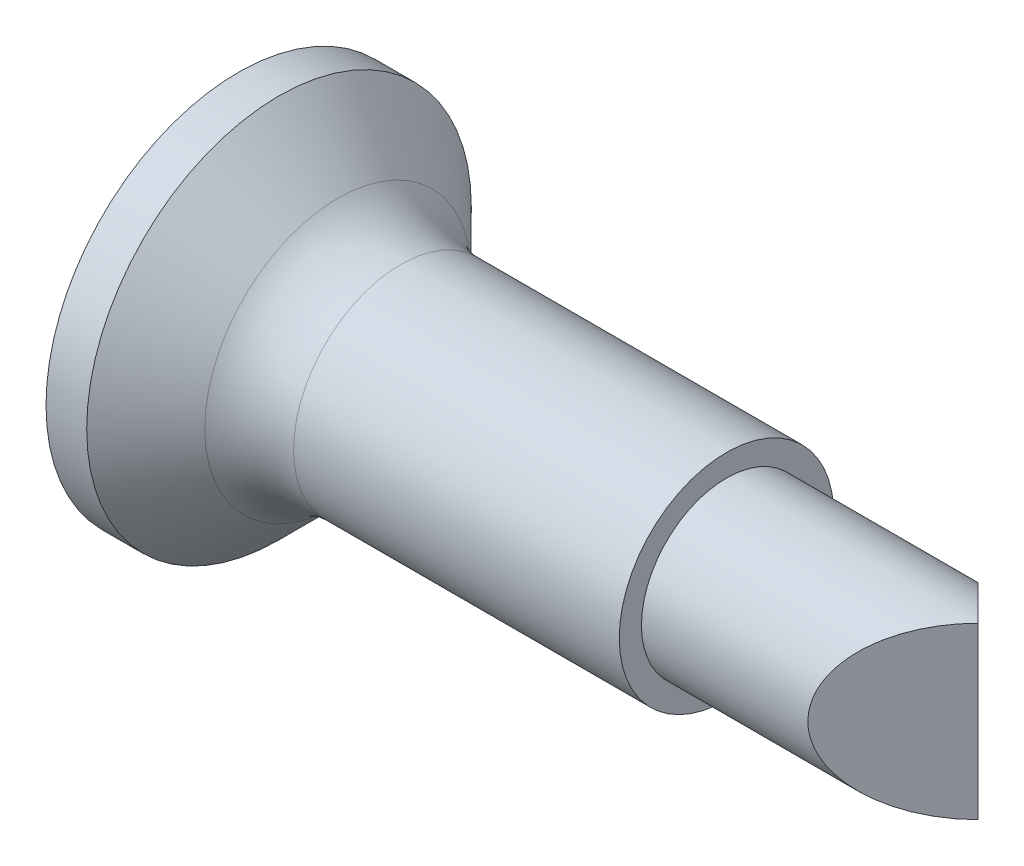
from build123d import *

# Parameters (mm, degrees)
CUT_EXTRUDE1_DEPTH      = 12.314150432
CUT_EXTRUDE1_DEPTH_BACK = 12.314150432
CROSSRECESS_DEPTH       = 0.85
FILLET1_R               = 1.2
FILLET2_R               = 0.34
DRAFT1_ANGLE            = -25


with BuildPart() as part:
    # Sketch1 → Base (revolve)
    with BuildSketch(Plane.XY, mode=Mode.PRIVATE) as base_sk:
        with BuildLine():
            Line((0.7, 2.6), (1.25, 2.6))
            Line((1.25, 2.6), (2.4, 1.45))
            Line((2.4, 1.45), (7.3, 1.45))
            Line((7.3, 1.45), (7.3, 1.15))
            Line((7.3, 1.15), (10.7, 1.15))
            Line((10.7, 1.15), (10.7, 0))
            Line((10.7, 0), (0, 0))
            ThreePointArc((0, 0), (0.178061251, 1.346291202), (0.7, 2.6))
        make_face()
    revolve(base_sk.sketch.rotate(Axis((-68.714227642, 0, 0), (1, 0, 0)), 90), axis=Axis((-68.714227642, 0, 0), (1, 0, 0)))

    # Sketch2 → Cut-Extrude1 (cut, two sides: drawn at the far end of the back side and taken through both)
    with BuildSketch(Plane(origin=(0, 0, 0), x_dir=(1, 0, 0), z_dir=(0, 1, 0)).offset(-CUT_EXTRUDE1_DEPTH_BACK)):
        Polygon((10.7, 0), (-4.3, 15), (11.04657513, 15), (11.04657513, -15), (-4.3, -15), align=None)
    extrude(amount=CUT_EXTRUDE1_DEPTH + CUT_EXTRUDE1_DEPTH_BACK, mode=Mode.SUBTRACT)

    # Sketch3 → CrossRecess (cut)
    with BuildSketch(Plane(origin=(0, 0, 0), x_dir=(0, 0, -1), z_dir=(1, 0, 0))):
        Polygon((-0.34, 0.34), (-1.7, 0.34), (-1.7, -0.34), (-0.34, -0.34), (-0.34, -1.7), (0.34, -1.7), (0.34, -0.34), (1.7, -0.34), (1.7, 0.34), (0.34, 0.34), (0.34, 1.7), (-0.34, 1.7), align=None)
    extrude(amount=CROSSRECESS_DEPTH, mode=Mode.SUBTRACT)

    # Fillet1
    fillet1_edges = [part.edges().sort_by_distance(p)[0] for p in [
        (2.4, 0, -1.45),
    ]]
    fillet(fillet1_edges, radius=FILLET1_R)

    # Fillet2
    fillet2_edges = [part.edges().sort_by_distance(p)[0] for p in [
        (0.43618554, -0.34, -0.34),
        (0.43618554, 0.34, -0.34),
        (0.43618554, 0.34, 0.34),
        (0.43618554, -0.34, 0.34),
    ]]
    fillet(fillet2_edges, radius=FILLET2_R)

    # Draft1
    draft1_faces = [part.faces().sort_by_distance(p)[0] for p in [
        (0.57045298, 0, 1.7),
        (0.57045298, 1.7, 0),
        (0.57045298, -1.7, 0),
        (0.57045298, 0, -1.7),
    ]]
    draft(draft1_faces, Plane(origin=(0, 0, 0), x_dir=(0, 0, 1), z_dir=(1, 0, 0)), DRAFT1_ANGLE)


solid = part.part
